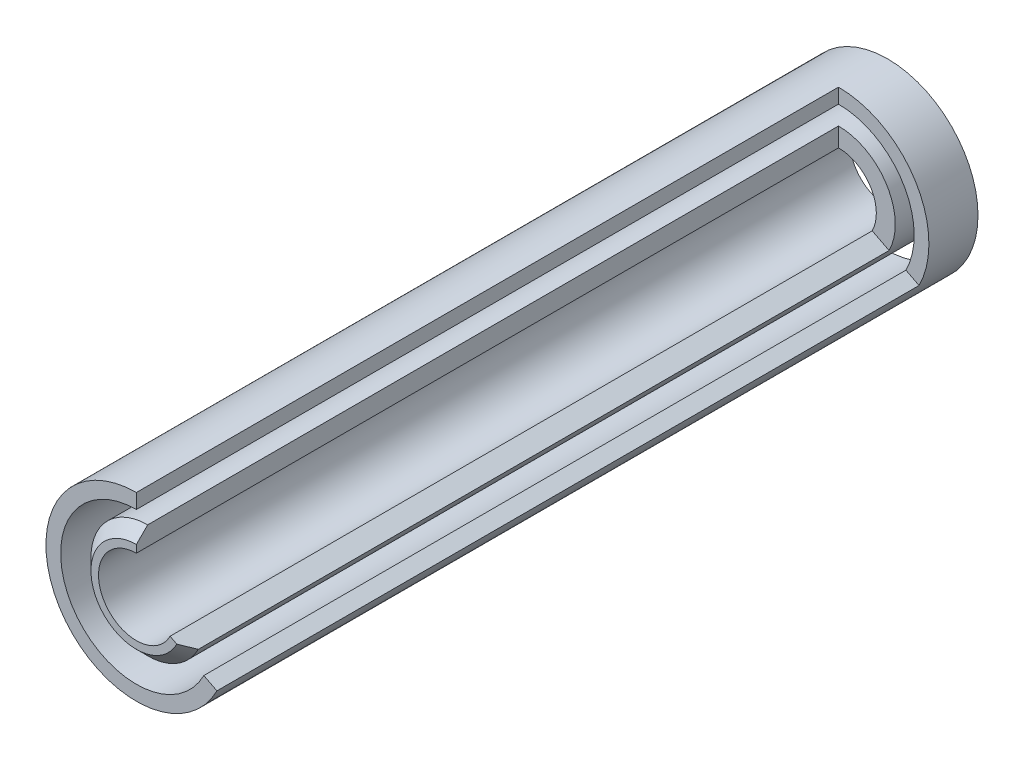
ISO-10303-21;
HEADER;
FILE_DESCRIPTION(('STEP AP214'),'2;1');
FILE_NAME('part.step','',(''),(''),'','','');
FILE_SCHEMA(('AUTOMOTIVE_DESIGN { 1 0 10303 214 1 1 1 1 }'));
ENDSEC;
DATA;
#1=APPLICATION_CONTEXT('core data for automotive mechanical design processes');
#2=APPLICATION_PROTOCOL_DEFINITION('international standard','automotive_design',2000,#1);
#3=PRODUCT_CONTEXT('',#1,'mechanical');
#4=PRODUCT('Part','Part','',(#3));
#5=PRODUCT_RELATED_PRODUCT_CATEGORY('part','',(#4));
#6=PRODUCT_DEFINITION_FORMATION('','',#4);
#7=PRODUCT_DEFINITION_CONTEXT('part definition',#1,'design');
#8=PRODUCT_DEFINITION('design','',#6,#7);
#9=PRODUCT_DEFINITION_SHAPE('','',#8);
#10=(LENGTH_UNIT() NAMED_UNIT(*) SI_UNIT(.MILLI.,.METRE.));
#11=(NAMED_UNIT(*) PLANE_ANGLE_UNIT() SI_UNIT($,.RADIAN.));
#12=(NAMED_UNIT(*) SI_UNIT($,.STERADIAN.) SOLID_ANGLE_UNIT());
#13=UNCERTAINTY_MEASURE_WITH_UNIT(LENGTH_MEASURE(1.E-05),#10,'distance_accuracy_value','');
#14=(GEOMETRIC_REPRESENTATION_CONTEXT(3) GLOBAL_UNCERTAINTY_ASSIGNED_CONTEXT((#13)) GLOBAL_UNIT_ASSIGNED_CONTEXT((#10,
#11,#12)) REPRESENTATION_CONTEXT('',''));
#15=CARTESIAN_POINT('',(0.,0.,0.));
#16=DIRECTION('',(0.,0.,1.));
#17=DIRECTION('',(1.,0.,0.));
#18=AXIS2_PLACEMENT_3D('',#15,#16,#17);
#19=CARTESIAN_POINT('',(0.,0.,-13.1025021));
#20=DIRECTION('',(0.,0.,1.));
#21=DIRECTION('',(1.,0.,0.));
#22=AXIS2_PLACEMENT_3D('',#19,#20,#21);
#23=CYLINDRICAL_SURFACE('',#22,9.825);
#24=CARTESIAN_POINT('',(0.,0.,128.0499979));
#25=DIRECTION('',(0.,0.,1.));
#26=DIRECTION('',(1.,0.,0.));
#27=AXIS2_PLACEMENT_3D('',#24,#25,#26);
#28=CIRCLE('',#27,9.825);
#29=CARTESIAN_POINT('',(8.75413910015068,-4.46045665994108,128.0499979));
#30=VERTEX_POINT('',#29);
#31=CARTESIAN_POINT('',(0.,9.82499999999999,128.0499979));
#32=VERTEX_POINT('',#31);
#33=EDGE_CURVE('E129',#30,#32,#28,.F.);
#34=ORIENTED_EDGE('',*,*,#33,.T.);
#35=DIRECTION('',(0.,0.,1.));
#36=VECTOR('',#35,1.);
#37=CARTESIAN_POINT('',(0.,9.825,-13.1025021));
#38=LINE('',#37,#36);
#39=CARTESIAN_POINT('',(0.,9.825,8.49618000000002));
#40=VERTEX_POINT('',#39);
#41=EDGE_CURVE('E114',#32,#40,#38,.F.);
#42=ORIENTED_EDGE('',*,*,#41,.T.);
#43=CARTESIAN_POINT('',(0.,0.,8.49618000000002));
#44=DIRECTION('',(0.,0.,1.));
#45=DIRECTION('',(1.,0.,0.));
#46=AXIS2_PLACEMENT_3D('',#43,#44,#45);
#47=CIRCLE('',#46,9.825);
#48=CARTESIAN_POINT('',(8.7541391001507,-4.46045665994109,8.49618000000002));
#49=VERTEX_POINT('',#48);
#50=EDGE_CURVE('E123',#40,#49,#47,.F.);
#51=ORIENTED_EDGE('',*,*,#50,.T.);
#52=DIRECTION('',(0.,0.,1.));
#53=VECTOR('',#52,1.);
#54=CARTESIAN_POINT('',(8.7541391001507,-4.46045665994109,-13.1025021));
#55=LINE('',#54,#53);
#56=EDGE_CURVE('E106',#30,#49,#55,.F.);
#57=ORIENTED_EDGE('',*,*,#56,.F.);
#58=EDGE_LOOP('',(#34,#42,#51,#57));
#59=FACE_BOUND('',#58,.T.);
#60=CARTESIAN_POINT('',(0.,0.,0.));
#61=DIRECTION('',(0.,0.,-1.));
#62=DIRECTION('',(-1.,0.,0.));
#63=AXIS2_PLACEMENT_3D('',#60,#61,#62);
#64=CIRCLE('',#63,9.825);
#65=CARTESIAN_POINT('',(-9.825,0.,0.));
#66=VERTEX_POINT('',#65);
#67=EDGE_CURVE('E141',#66,#66,#64,.F.);
#68=ORIENTED_EDGE('',*,*,#67,.T.);
#69=EDGE_LOOP('',(#68));
#70=FACE_BOUND('',#69,.T.);
#71=ADVANCED_FACE('F47',(#59,#70),#23,.T.);
#72=CARTESIAN_POINT('',(0.,0.,-13.1025021));
#73=DIRECTION('',(0.,0.,1.));
#74=DIRECTION('',(1.,0.,0.));
#75=AXIS2_PLACEMENT_3D('',#72,#73,#74);
#76=CYLINDRICAL_SURFACE('',#75,6.55);
#77=DIRECTION('',(0.,0.,1.));
#78=VECTOR('',#77,1.);
#79=CARTESIAN_POINT('',(0.,6.55,-13.1025021));
#80=LINE('',#79,#78);
#81=CARTESIAN_POINT('',(0.,6.55,130.0149979));
#82=VERTEX_POINT('',#81);
#83=CARTESIAN_POINT('',(0.,6.55,8.49618000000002));
#84=VERTEX_POINT('',#83);
#85=EDGE_CURVE('E121',#82,#84,#80,.F.);
#86=ORIENTED_EDGE('',*,*,#85,.F.);
#87=CARTESIAN_POINT('',(0.,0.,130.0149979));
#88=DIRECTION('',(0.,0.,1.));
#89=DIRECTION('',(1.,0.,0.));
#90=AXIS2_PLACEMENT_3D('',#87,#88,#89);
#91=CIRCLE('',#90,6.55);
#92=CARTESIAN_POINT('',(5.8360927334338,-2.97363777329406,130.0149979));
#93=VERTEX_POINT('',#92);
#94=EDGE_CURVE('E112',#82,#93,#91,.T.);
#95=ORIENTED_EDGE('',*,*,#94,.T.);
#96=DIRECTION('',(0.,0.,1.));
#97=VECTOR('',#96,1.);
#98=CARTESIAN_POINT('',(5.8360927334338,-2.97363777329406,-13.1025021));
#99=LINE('',#98,#97);
#100=CARTESIAN_POINT('',(5.8360927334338,-2.97363777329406,8.49618000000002));
#101=VERTEX_POINT('',#100);
#102=EDGE_CURVE('E104',#93,#101,#99,.F.);
#103=ORIENTED_EDGE('',*,*,#102,.T.);
#104=CARTESIAN_POINT('',(0.,0.,8.49618000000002));
#105=DIRECTION('',(0.,0.,1.));
#106=DIRECTION('',(1.,0.,0.));
#107=AXIS2_PLACEMENT_3D('',#104,#105,#106);
#108=CIRCLE('',#107,6.55);
#109=EDGE_CURVE('E12',#84,#101,#108,.F.);
#110=ORIENTED_EDGE('',*,*,#109,.F.);
#111=EDGE_LOOP('',(#86,#95,#103,#110));
#112=FACE_BOUND('',#111,.T.);
#113=CARTESIAN_POINT('',(0.,0.,0.));
#114=DIRECTION('',(0.,0.,-1.));
#115=DIRECTION('',(-1.,0.,0.));
#116=AXIS2_PLACEMENT_3D('',#113,#114,#115);
#117=CIRCLE('',#116,6.55);
#118=CARTESIAN_POINT('',(-6.55,0.,0.));
#119=VERTEX_POINT('',#118);
#120=EDGE_CURVE('E51',#119,#119,#117,.F.);
#121=ORIENTED_EDGE('',*,*,#120,.F.);
#122=EDGE_LOOP('',(#121));
#123=FACE_BOUND('',#122,.T.);
#124=ADVANCED_FACE('F109',(#112,#123),#76,.F.);
#125=CARTESIAN_POINT('',(0.,0.,130.0149979));
#126=DIRECTION('',(0.,0.,1.));
#127=DIRECTION('',(1.,0.,0.));
#128=AXIS2_PLACEMENT_3D('',#125,#126,#127);
#129=PLANE('',#128);
#130=ORIENTED_EDGE('',*,*,#94,.F.);
#131=DIRECTION('',(0.,1.,0.));
#132=VECTOR('',#131,1.);
#133=CARTESIAN_POINT('',(0.,0.,130.0149979));
#134=LINE('',#133,#132);
#135=CARTESIAN_POINT('',(0.,7.86,130.0149979));
#136=VERTEX_POINT('',#135);
#137=EDGE_CURVE('E71',#82,#136,#134,.T.);
#138=ORIENTED_EDGE('',*,*,#137,.T.);
#139=CARTESIAN_POINT('',(0.,0.,130.0149979));
#140=DIRECTION('',(0.,0.,1.));
#141=DIRECTION('',(1.,0.,0.));
#142=AXIS2_PLACEMENT_3D('',#139,#140,#141);
#143=CIRCLE('',#142,7.86000000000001);
#144=CARTESIAN_POINT('',(7.00331128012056,-3.56836532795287,130.0149979));
#145=VERTEX_POINT('',#144);
#146=EDGE_CURVE('E126',#136,#145,#143,.T.);
#147=ORIENTED_EDGE('',*,*,#146,.T.);
#148=DIRECTION('',(0.891006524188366,-0.453990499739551,0.));
#149=VECTOR('',#148,1.);
#150=CARTESIAN_POINT('',(0.,0.,130.0149979));
#151=LINE('',#150,#149);
#152=EDGE_CURVE('E63',#93,#145,#151,.T.);
#153=ORIENTED_EDGE('',*,*,#152,.F.);
#154=EDGE_LOOP('',(#130,#138,#147,#153));
#155=FACE_BOUND('',#154,.T.);
#156=ADVANCED_FACE('F151',(#155),#129,.T.);
#157=CARTESIAN_POINT('',(0.,0.,130.0149979));
#158=DIRECTION('',(0.,0.,-1.));
#159=DIRECTION('',(-1.,0.,0.));
#160=AXIS2_PLACEMENT_3D('',#157,#158,#159);
#161=CONICAL_SURFACE('',#160,7.86000000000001,0.785398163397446);
#162=ORIENTED_EDGE('',*,*,#146,.F.);
#163=DIRECTION('',(0.,-0.707106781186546,0.707106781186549));
#164=VECTOR('',#163,1.);
#165=CARTESIAN_POINT('',(0.,0.,137.8749979));
#166=LINE('',#165,#164);
#167=EDGE_CURVE('E56',#136,#32,#166,.F.);
#168=ORIENTED_EDGE('',*,*,#167,.T.);
#169=ORIENTED_EDGE('',*,*,#33,.F.);
#170=DIRECTION('',(-0.630036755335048,0.321019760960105,0.707106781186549));
#171=VECTOR('',#170,1.);
#172=CARTESIAN_POINT('',(0.,0.,137.8749979));
#173=LINE('',#172,#171);
#174=EDGE_CURVE('E132',#145,#30,#173,.F.);
#175=ORIENTED_EDGE('',*,*,#174,.F.);
#176=EDGE_LOOP('',(#162,#168,#169,#175));
#177=FACE_BOUND('',#176,.T.);
#178=ADVANCED_FACE('F49',(#177),#161,.T.);
#179=CARTESIAN_POINT('',(0.,0.,8.49618000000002));
#180=DIRECTION('',(0.,0.,1.));
#181=DIRECTION('',(1.,0.,0.));
#182=AXIS2_PLACEMENT_3D('',#179,#180,#181);
#183=PLANE('',#182);
#184=DIRECTION('',(0.,1.,0.));
#185=VECTOR('',#184,1.);
#186=CARTESIAN_POINT('',(0.,0.,8.49618000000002));
#187=LINE('',#186,#185);
#188=EDGE_CURVE('E100',#84,#40,#187,.T.);
#189=ORIENTED_EDGE('',*,*,#188,.F.);
#190=ORIENTED_EDGE('',*,*,#109,.T.);
#191=DIRECTION('',(0.891006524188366,-0.453990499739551,0.));
#192=VECTOR('',#191,1.);
#193=CARTESIAN_POINT('',(0.,0.,8.49618000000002));
#194=LINE('',#193,#192);
#195=EDGE_CURVE('E97',#101,#49,#194,.T.);
#196=ORIENTED_EDGE('',*,*,#195,.T.);
#197=ORIENTED_EDGE('',*,*,#50,.F.);
#198=EDGE_LOOP('',(#189,#190,#196,#197));
#199=FACE_BOUND('',#198,.T.);
#200=ADVANCED_FACE('F96',(#199),#183,.T.);
#201=CARTESIAN_POINT('',(0.,0.,8.49618000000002));
#202=DIRECTION('',(1.,0.,0.));
#203=DIRECTION('',(0.,0.,-1.));
#204=AXIS2_PLACEMENT_3D('',#201,#202,#203);
#205=PLANE('',#204);
#206=ORIENTED_EDGE('',*,*,#85,.T.);
#207=ORIENTED_EDGE('',*,*,#188,.T.);
#208=ORIENTED_EDGE('',*,*,#41,.F.);
#209=ORIENTED_EDGE('',*,*,#167,.F.);
#210=ORIENTED_EDGE('',*,*,#137,.F.);
#211=EDGE_LOOP('',(#206,#207,#208,#209,#210));
#212=FACE_BOUND('',#211,.T.);
#213=ADVANCED_FACE('F140',(#212),#205,.T.);
#214=CARTESIAN_POINT('',(0.,0.,8.49618000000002));
#215=DIRECTION('',(-0.453990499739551,-0.891006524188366,0.));
#216=DIRECTION('',(0.891006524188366,-0.453990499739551,0.));
#217=AXIS2_PLACEMENT_3D('',#214,#215,#216);
#218=PLANE('',#217);
#219=ORIENTED_EDGE('',*,*,#152,.T.);
#220=ORIENTED_EDGE('',*,*,#174,.T.);
#221=ORIENTED_EDGE('',*,*,#56,.T.);
#222=ORIENTED_EDGE('',*,*,#195,.F.);
#223=ORIENTED_EDGE('',*,*,#102,.F.);
#224=EDGE_LOOP('',(#219,#220,#221,#222,#223));
#225=FACE_BOUND('',#224,.T.);
#226=ADVANCED_FACE('F103',(#225),#218,.F.);
#227=CARTESIAN_POINT('',(0.,0.,0.));
#228=DIRECTION('',(0.,0.,-1.));
#229=DIRECTION('',(-1.,0.,0.));
#230=AXIS2_PLACEMENT_3D('',#227,#228,#229);
#231=PLANE('',#230);
#232=ORIENTED_EDGE('',*,*,#67,.F.);
#233=EDGE_LOOP('',(#232));
#234=FACE_BOUND('',#233,.T.);
#235=ORIENTED_EDGE('',*,*,#120,.T.);
#236=EDGE_LOOP('',(#235));
#237=FACE_BOUND('',#236,.T.);
#238=ADVANCED_FACE('F149',(#234,#237),#231,.T.);
#239=CLOSED_SHELL('',(#71,#124,#156,#178,#200,#213,#226,#238));
#240=MANIFOLD_SOLID_BREP('B2',#239);
#241=CARTESIAN_POINT('',(0.,0.,130.0149979));
#242=DIRECTION('',(0.,0.,1.));
#243=DIRECTION('',(1.,0.,0.));
#244=AXIS2_PLACEMENT_3D('',#241,#242,#243);
#245=PLANE('',#244);
#246=CARTESIAN_POINT('',(0.,0.,130.0149979));
#247=DIRECTION('',(0.,0.,1.));
#248=DIRECTION('',(1.,0.,0.));
#249=AXIS2_PLACEMENT_3D('',#246,#247,#248);
#250=CIRCLE('',#249,13.1);
#251=CARTESIAN_POINT('',(0.,13.1,130.0149979));
#252=VERTEX_POINT('',#251);
#253=CARTESIAN_POINT('',(11.6721854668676,-5.94727554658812,130.0149979));
#254=VERTEX_POINT('',#253);
#255=EDGE_CURVE('E282',#252,#254,#250,.T.);
#256=ORIENTED_EDGE('',*,*,#255,.F.);
#257=DIRECTION('',(0.,1.,0.));
#258=VECTOR('',#257,1.);
#259=CARTESIAN_POINT('',(0.,0.,130.0149979));
#260=LINE('',#259,#258);
#261=CARTESIAN_POINT('',(0.,15.649915,130.0149979));
#262=VERTEX_POINT('',#261);
#263=EDGE_CURVE('E279',#252,#262,#260,.T.);
#264=ORIENTED_EDGE('',*,*,#263,.T.);
#265=CARTESIAN_POINT('',(0.,0.,130.0149979));
#266=DIRECTION('',(0.,0.,1.));
#267=DIRECTION('',(1.,0.,0.));
#268=AXIS2_PLACEMENT_3D('',#265,#266,#267);
#269=CIRCLE('',#268,15.649915);
#270=CARTESIAN_POINT('',(13.9441763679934,-7.10491273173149,130.0149979));
#271=VERTEX_POINT('',#270);
#272=EDGE_CURVE('E277',#262,#271,#269,.T.);
#273=ORIENTED_EDGE('',*,*,#272,.T.);
#274=DIRECTION('',(0.891006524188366,-0.453990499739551,0.));
#275=VECTOR('',#274,1.);
#276=CARTESIAN_POINT('',(0.,0.,130.0149979));
#277=LINE('',#276,#275);
#278=EDGE_CURVE('E270',#254,#271,#277,.T.);
#279=ORIENTED_EDGE('',*,*,#278,.F.);
#280=EDGE_LOOP('',(#256,#264,#273,#279));
#281=FACE_BOUND('',#280,.T.);
#282=ADVANCED_FACE('F224',(#281),#245,.T.);
#283=CARTESIAN_POINT('',(0.,0.,130.0149979));
#284=DIRECTION('',(0.,0.,-1.));
#285=DIRECTION('',(-1.,0.,0.));
#286=AXIS2_PLACEMENT_3D('',#283,#284,#285);
#287=CYLINDRICAL_SURFACE('',#286,15.649915);
#288=CARTESIAN_POINT('',(0.,0.,0.));
#289=DIRECTION('',(0.,0.,1.));
#290=DIRECTION('',(1.,0.,0.));
#291=AXIS2_PLACEMENT_3D('',#288,#289,#290);
#292=CIRCLE('',#291,15.649915);
#293=CARTESIAN_POINT('',(15.649915,0.,0.));
#294=VERTEX_POINT('',#293);
#295=EDGE_CURVE('E289',#294,#294,#292,.T.);
#296=ORIENTED_EDGE('',*,*,#295,.T.);
#297=EDGE_LOOP('',(#296));
#298=FACE_BOUND('',#297,.T.);
#299=DIRECTION('',(0.,0.,-1.));
#300=VECTOR('',#299,1.);
#301=CARTESIAN_POINT('',(0.,15.649915,130.0149979));
#302=LINE('',#301,#300);
#303=CARTESIAN_POINT('',(0.,15.649915,8.49618000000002));
#304=VERTEX_POINT('',#303);
#305=EDGE_CURVE('E246',#304,#262,#302,.F.);
#306=ORIENTED_EDGE('',*,*,#305,.F.);
#307=CARTESIAN_POINT('',(0.,0.,8.49618000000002));
#308=DIRECTION('',(0.,0.,1.));
#309=DIRECTION('',(1.,0.,0.));
#310=AXIS2_PLACEMENT_3D('',#307,#308,#309);
#311=CIRCLE('',#310,15.649915);
#312=CARTESIAN_POINT('',(13.9441763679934,-7.10491273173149,8.49618000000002));
#313=VERTEX_POINT('',#312);
#314=EDGE_CURVE('E264',#313,#304,#311,.T.);
#315=ORIENTED_EDGE('',*,*,#314,.F.);
#316=DIRECTION('',(0.,0.,-1.));
#317=VECTOR('',#316,1.);
#318=CARTESIAN_POINT('',(13.9441763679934,-7.10491273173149,130.0149979));
#319=LINE('',#318,#317);
#320=EDGE_CURVE('E284',#313,#271,#319,.F.);
#321=ORIENTED_EDGE('',*,*,#320,.T.);
#322=ORIENTED_EDGE('',*,*,#272,.F.);
#323=EDGE_LOOP('',(#306,#315,#321,#322));
#324=FACE_BOUND('',#323,.T.);
#325=ADVANCED_FACE('F226',(#298,#324),#287,.T.);
#326=CARTESIAN_POINT('',(0.,0.,130.0149979));
#327=DIRECTION('',(0.,0.,-1.));
#328=DIRECTION('',(-1.,0.,0.));
#329=AXIS2_PLACEMENT_3D('',#326,#327,#328);
#330=CYLINDRICAL_SURFACE('',#329,13.1);
#331=CARTESIAN_POINT('',(0.,0.,0.));
#332=DIRECTION('',(0.,0.,1.));
#333=DIRECTION('',(1.,0.,0.));
#334=AXIS2_PLACEMENT_3D('',#331,#332,#333);
#335=CIRCLE('',#334,13.1);
#336=CARTESIAN_POINT('',(13.1,0.,0.));
#337=VERTEX_POINT('',#336);
#338=EDGE_CURVE('E278',#337,#337,#335,.T.);
#339=ORIENTED_EDGE('',*,*,#338,.F.);
#340=EDGE_LOOP('',(#339));
#341=FACE_BOUND('',#340,.T.);
#342=CARTESIAN_POINT('',(0.,0.,8.49618000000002));
#343=DIRECTION('',(0.,0.,1.));
#344=DIRECTION('',(1.,0.,0.));
#345=AXIS2_PLACEMENT_3D('',#342,#343,#344);
#346=CIRCLE('',#345,13.1);
#347=CARTESIAN_POINT('',(11.6721854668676,-5.94727554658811,8.49618000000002));
#348=VERTEX_POINT('',#347);
#349=CARTESIAN_POINT('',(0.,13.1,8.49618000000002));
#350=VERTEX_POINT('',#349);
#351=EDGE_CURVE('E292',#348,#350,#346,.T.);
#352=ORIENTED_EDGE('',*,*,#351,.T.);
#353=DIRECTION('',(0.,0.,-1.));
#354=VECTOR('',#353,1.);
#355=CARTESIAN_POINT('',(0.,13.1,130.0149979));
#356=LINE('',#355,#354);
#357=EDGE_CURVE('E45',#350,#252,#356,.F.);
#358=ORIENTED_EDGE('',*,*,#357,.T.);
#359=ORIENTED_EDGE('',*,*,#255,.T.);
#360=DIRECTION('',(0.,0.,-1.));
#361=VECTOR('',#360,1.);
#362=CARTESIAN_POINT('',(11.6721854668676,-5.94727554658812,130.0149979));
#363=LINE('',#362,#361);
#364=EDGE_CURVE('E232',#348,#254,#363,.F.);
#365=ORIENTED_EDGE('',*,*,#364,.F.);
#366=EDGE_LOOP('',(#352,#358,#359,#365));
#367=FACE_BOUND('',#366,.T.);
#368=ADVANCED_FACE('F303',(#341,#367),#330,.F.);
#369=CARTESIAN_POINT('',(0.,0.,0.));
#370=DIRECTION('',(0.,0.,1.));
#371=DIRECTION('',(1.,0.,0.));
#372=AXIS2_PLACEMENT_3D('',#369,#370,#371);
#373=PLANE('',#372);
#374=ORIENTED_EDGE('',*,*,#295,.F.);
#375=EDGE_LOOP('',(#374));
#376=FACE_BOUND('',#375,.T.);
#377=ORIENTED_EDGE('',*,*,#338,.T.);
#378=EDGE_LOOP('',(#377));
#379=FACE_BOUND('',#378,.T.);
#380=ADVANCED_FACE('F305',(#376,#379),#373,.F.);
#381=CARTESIAN_POINT('',(0.,0.,8.49618000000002));
#382=DIRECTION('',(1.,0.,0.));
#383=DIRECTION('',(0.,0.,-1.));
#384=AXIS2_PLACEMENT_3D('',#381,#382,#383);
#385=PLANE('',#384);
#386=ORIENTED_EDGE('',*,*,#305,.T.);
#387=ORIENTED_EDGE('',*,*,#263,.F.);
#388=ORIENTED_EDGE('',*,*,#357,.F.);
#389=DIRECTION('',(0.,1.,0.));
#390=VECTOR('',#389,1.);
#391=CARTESIAN_POINT('',(0.,0.,8.49618000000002));
#392=LINE('',#391,#390);
#393=EDGE_CURVE('E239',#350,#304,#392,.T.);
#394=ORIENTED_EDGE('',*,*,#393,.T.);
#395=EDGE_LOOP('',(#386,#387,#388,#394));
#396=FACE_BOUND('',#395,.T.);
#397=ADVANCED_FACE('F272',(#396),#385,.T.);
#398=CARTESIAN_POINT('',(0.,0.,8.49618000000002));
#399=DIRECTION('',(-0.453990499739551,-0.891006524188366,0.));
#400=DIRECTION('',(0.891006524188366,-0.453990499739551,0.));
#401=AXIS2_PLACEMENT_3D('',#398,#399,#400);
#402=PLANE('',#401);
#403=DIRECTION('',(0.891006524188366,-0.453990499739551,0.));
#404=VECTOR('',#403,1.);
#405=CARTESIAN_POINT('',(0.,0.,8.49618000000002));
#406=LINE('',#405,#404);
#407=EDGE_CURVE('E267',#348,#313,#406,.T.);
#408=ORIENTED_EDGE('',*,*,#407,.F.);
#409=ORIENTED_EDGE('',*,*,#364,.T.);
#410=ORIENTED_EDGE('',*,*,#278,.T.);
#411=ORIENTED_EDGE('',*,*,#320,.F.);
#412=EDGE_LOOP('',(#408,#409,#410,#411));
#413=FACE_BOUND('',#412,.T.);
#414=ADVANCED_FACE('F298',(#413),#402,.F.);
#415=CARTESIAN_POINT('',(0.,0.,8.49618000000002));
#416=DIRECTION('',(0.,0.,1.));
#417=DIRECTION('',(1.,0.,0.));
#418=AXIS2_PLACEMENT_3D('',#415,#416,#417);
#419=PLANE('',#418);
#420=ORIENTED_EDGE('',*,*,#314,.T.);
#421=ORIENTED_EDGE('',*,*,#393,.F.);
#422=ORIENTED_EDGE('',*,*,#351,.F.);
#423=ORIENTED_EDGE('',*,*,#407,.T.);
#424=EDGE_LOOP('',(#420,#421,#422,#423));
#425=FACE_BOUND('',#424,.T.);
#426=ADVANCED_FACE('F265',(#425),#419,.T.);
#427=CLOSED_SHELL('',(#282,#325,#368,#380,#397,#414,#426));
#428=MANIFOLD_SOLID_BREP('B6',#427);
#429=ADVANCED_BREP_SHAPE_REPRESENTATION('',(#18,#240,#428),#14);
#430=SHAPE_DEFINITION_REPRESENTATION(#9,#429);
ENDSEC;
END-ISO-10303-21;
